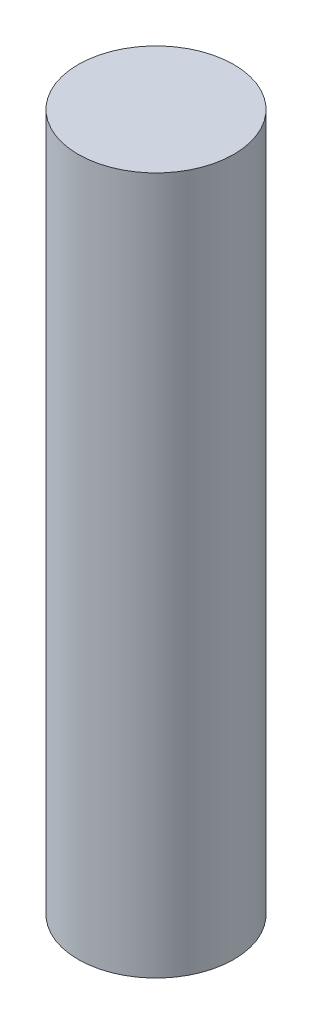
from build123d import *

# Parameters (mm, degrees)
SKETCH1_R           = 0.79375
BOSS_EXTRUDE1_DEPTH = 7.112


with BuildPart() as part:
    # Sketch1 → Boss-Extrude1 (new body)
    with BuildSketch(Plane(origin=(0, 0, 0), x_dir=(1, 0, 0), z_dir=(0, 1, 0))):
        with Locations(Location((0, 0, 0), (0, 0, 270))):
            Circle(SKETCH1_R)
    extrude(amount=BOSS_EXTRUDE1_DEPTH)


solid = part.part
